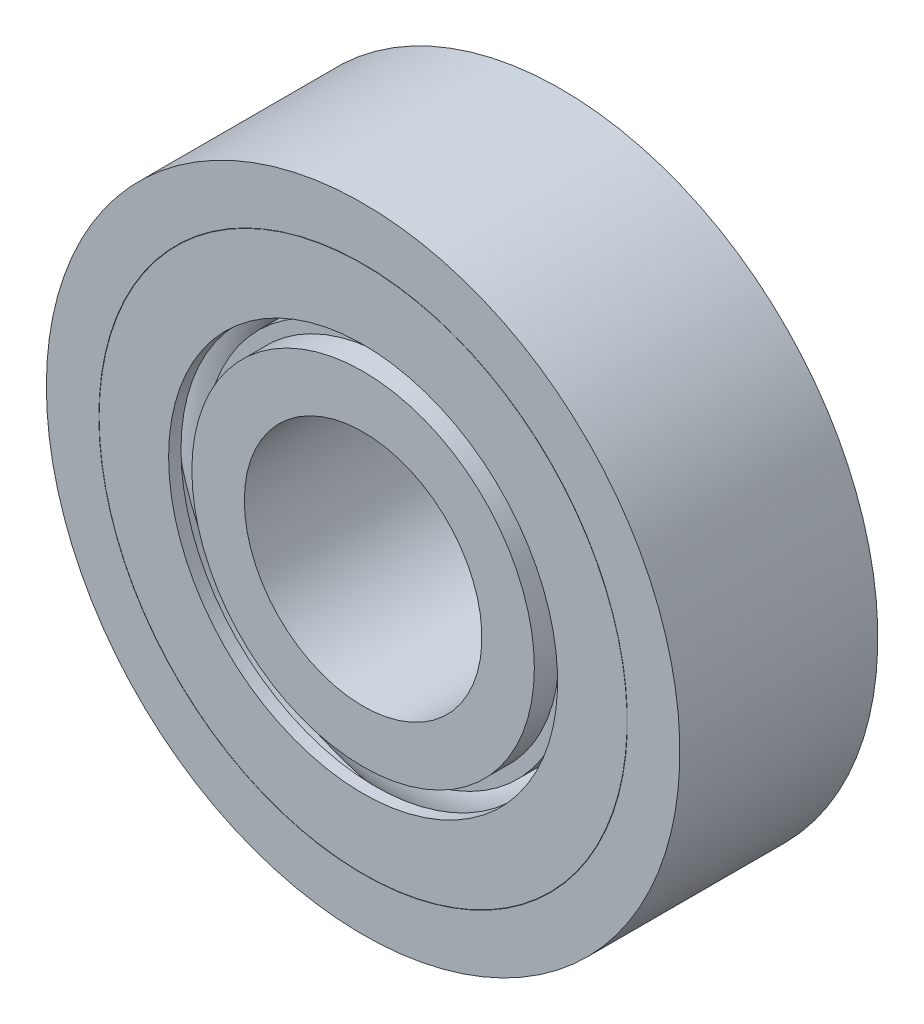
ISO-10303-21;
HEADER;
FILE_DESCRIPTION(('STEP AP214'),'2;1');
FILE_NAME('part.step','',(''),(''),'','','');
FILE_SCHEMA(('AUTOMOTIVE_DESIGN { 1 0 10303 214 1 1 1 1 }'));
ENDSEC;
DATA;
#1=APPLICATION_CONTEXT('core data for automotive mechanical design processes');
#2=APPLICATION_PROTOCOL_DEFINITION('international standard','automotive_design',2000,#1);
#3=PRODUCT_CONTEXT('',#1,'mechanical');
#4=PRODUCT('Part','Part','',(#3));
#5=PRODUCT_RELATED_PRODUCT_CATEGORY('part','',(#4));
#6=PRODUCT_DEFINITION_FORMATION('','',#4);
#7=PRODUCT_DEFINITION_CONTEXT('part definition',#1,'design');
#8=PRODUCT_DEFINITION('design','',#6,#7);
#9=PRODUCT_DEFINITION_SHAPE('','',#8);
#10=(LENGTH_UNIT() NAMED_UNIT(*) SI_UNIT(.MILLI.,.METRE.));
#11=(NAMED_UNIT(*) PLANE_ANGLE_UNIT() SI_UNIT($,.RADIAN.));
#12=(NAMED_UNIT(*) SI_UNIT($,.STERADIAN.) SOLID_ANGLE_UNIT());
#13=UNCERTAINTY_MEASURE_WITH_UNIT(LENGTH_MEASURE(1.E-05),#10,'distance_accuracy_value','');
#14=(GEOMETRIC_REPRESENTATION_CONTEXT(3) GLOBAL_UNCERTAINTY_ASSIGNED_CONTEXT((#13)) GLOBAL_UNIT_ASSIGNED_CONTEXT((#10,
#11,#12)) REPRESENTATION_CONTEXT('',''));
#15=CARTESIAN_POINT('',(0.,0.,0.));
#16=DIRECTION('',(0.,0.,1.));
#17=DIRECTION('',(1.,0.,0.));
#18=AXIS2_PLACEMENT_3D('',#15,#16,#17);
#19=CARTESIAN_POINT('',(0.,0.,5.50000000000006));
#20=DIRECTION('',(0.,0.,-1.));
#21=DIRECTION('',(-1.,0.,0.));
#22=AXIS2_PLACEMENT_3D('',#19,#20,#21);
#23=CYLINDRICAL_SURFACE('',#22,6.);
#24=CARTESIAN_POINT('',(0.,0.,5.));
#25=DIRECTION('',(0.,0.,-1.));
#26=DIRECTION('',(-1.,0.,0.));
#27=AXIS2_PLACEMENT_3D('',#24,#25,#26);
#28=CIRCLE('',#27,6.);
#29=CARTESIAN_POINT('',(-6.,0.,5.));
#30=VERTEX_POINT('',#29);
#31=EDGE_CURVE('P0_E18',#30,#30,#28,.F.);
#32=ORIENTED_EDGE('',*,*,#31,.T.);
#33=EDGE_LOOP('',(#32));
#34=FACE_BOUND('',#33,.T.);
#35=CARTESIAN_POINT('',(0.,0.,-5.));
#36=DIRECTION('',(0.,0.,-1.));
#37=DIRECTION('',(-1.,0.,0.));
#38=AXIS2_PLACEMENT_3D('',#35,#36,#37);
#39=CIRCLE('',#38,6.);
#40=CARTESIAN_POINT('',(-6.,0.,-5.));
#41=VERTEX_POINT('',#40);
#42=EDGE_CURVE('P0_E68',#41,#41,#39,.F.);
#43=ORIENTED_EDGE('',*,*,#42,.F.);
#44=EDGE_LOOP('',(#43));
#45=FACE_BOUND('',#44,.T.);
#46=ADVANCED_FACE('P0_F15',(#34,#45),#23,.F.);
#47=CARTESIAN_POINT('',(0.,0.,5.));
#48=DIRECTION('',(0.,0.,-1.));
#49=DIRECTION('',(-1.,0.,0.));
#50=AXIS2_PLACEMENT_3D('',#47,#48,#49);
#51=PLANE('',#50);
#52=CARTESIAN_POINT('',(0.,0.,5.));
#53=DIRECTION('',(0.,0.,-1.));
#54=DIRECTION('',(-1.,0.,0.));
#55=AXIS2_PLACEMENT_3D('',#52,#53,#54);
#56=CIRCLE('',#55,8.65);
#57=CARTESIAN_POINT('',(-8.65,0.,5.));
#58=VERTEX_POINT('',#57);
#59=EDGE_CURVE('P0_E66',#58,#58,#56,.T.);
#60=ORIENTED_EDGE('',*,*,#59,.F.);
#61=EDGE_LOOP('',(#60));
#62=FACE_BOUND('',#61,.T.);
#63=ORIENTED_EDGE('',*,*,#31,.F.);
#64=EDGE_LOOP('',(#63));
#65=FACE_BOUND('',#64,.T.);
#66=ADVANCED_FACE('P0_F77',(#62,#65),#51,.F.);
#67=CARTESIAN_POINT('',(0.,0.,-5.));
#68=DIRECTION('',(0.,0.,-1.));
#69=DIRECTION('',(-1.,0.,0.));
#70=AXIS2_PLACEMENT_3D('',#67,#68,#69);
#71=PLANE('',#70);
#72=CARTESIAN_POINT('',(0.,0.,-5.));
#73=DIRECTION('',(0.,0.,-1.));
#74=DIRECTION('',(-1.,0.,0.));
#75=AXIS2_PLACEMENT_3D('',#72,#73,#74);
#76=CIRCLE('',#75,8.65);
#77=CARTESIAN_POINT('',(-8.65,0.,-5.));
#78=VERTEX_POINT('',#77);
#79=EDGE_CURVE('P0_E63',#78,#78,#76,.F.);
#80=ORIENTED_EDGE('',*,*,#79,.F.);
#81=EDGE_LOOP('',(#80));
#82=FACE_BOUND('',#81,.T.);
#83=ORIENTED_EDGE('',*,*,#42,.T.);
#84=EDGE_LOOP('',(#83));
#85=FACE_BOUND('',#84,.T.);
#86=ADVANCED_FACE('P0_F79',(#82,#85),#71,.T.);
#87=CARTESIAN_POINT('',(0.,0.,5.50000000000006));
#88=DIRECTION('',(0.,0.,-1.));
#89=DIRECTION('',(-1.,0.,0.));
#90=AXIS2_PLACEMENT_3D('',#87,#88,#89);
#91=CYLINDRICAL_SURFACE('',#90,8.65);
#92=ORIENTED_EDGE('',*,*,#59,.T.);
#93=EDGE_LOOP('',(#92));
#94=FACE_BOUND('',#93,.T.);
#95=CARTESIAN_POINT('',(0.,0.,3.75000000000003));
#96=DIRECTION('',(0.,0.,-1.));
#97=DIRECTION('',(-1.,0.,0.));
#98=AXIS2_PLACEMENT_3D('',#95,#96,#97);
#99=CIRCLE('',#98,8.65);
#100=CARTESIAN_POINT('',(-8.65,0.,3.75000000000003));
#101=VERTEX_POINT('',#100);
#102=EDGE_CURVE('P0_E60',#101,#101,#99,.F.);
#103=ORIENTED_EDGE('',*,*,#102,.T.);
#104=EDGE_LOOP('',(#103));
#105=FACE_BOUND('',#104,.T.);
#106=ADVANCED_FACE('P0_F86',(#94,#105),#91,.T.);
#107=CARTESIAN_POINT('',(0.,0.,5.50000000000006));
#108=DIRECTION('',(0.,0.,-1.));
#109=DIRECTION('',(-1.,0.,0.));
#110=AXIS2_PLACEMENT_3D('',#107,#108,#109);
#111=CYLINDRICAL_SURFACE('',#110,8.65);
#112=ORIENTED_EDGE('',*,*,#79,.T.);
#113=EDGE_LOOP('',(#112));
#114=FACE_BOUND('',#113,.T.);
#115=CARTESIAN_POINT('',(0.,0.,-3.75000000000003));
#116=DIRECTION('',(0.,0.,-1.));
#117=DIRECTION('',(-1.,0.,0.));
#118=AXIS2_PLACEMENT_3D('',#115,#116,#117);
#119=CIRCLE('',#118,8.65);
#120=CARTESIAN_POINT('',(-8.65,0.,-3.75000000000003));
#121=VERTEX_POINT('',#120);
#122=EDGE_CURVE('P0_E57',#121,#121,#119,.F.);
#123=ORIENTED_EDGE('',*,*,#122,.F.);
#124=EDGE_LOOP('',(#123));
#125=FACE_BOUND('',#124,.T.);
#126=ADVANCED_FACE('P0_F173',(#114,#125),#111,.T.);
#127=CARTESIAN_POINT('',(0.,0.,3.75000000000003));
#128=DIRECTION('',(0.,0.,-1.));
#129=DIRECTION('',(-1.,0.,0.));
#130=AXIS2_PLACEMENT_3D('',#127,#128,#129);
#131=PLANE('',#130);
#132=CARTESIAN_POINT('',(0.,0.,3.75000000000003));
#133=DIRECTION('',(0.,0.,-1.));
#134=DIRECTION('',(-1.,0.,0.));
#135=AXIS2_PLACEMENT_3D('',#132,#133,#134);
#136=CIRCLE('',#135,9.26);
#137=CARTESIAN_POINT('',(-9.26,0.,3.75000000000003));
#138=VERTEX_POINT('',#137);
#139=EDGE_CURVE('P0_E54',#138,#138,#136,.T.);
#140=ORIENTED_EDGE('',*,*,#139,.F.);
#141=EDGE_LOOP('',(#140));
#142=FACE_BOUND('',#141,.T.);
#143=ORIENTED_EDGE('',*,*,#102,.F.);
#144=EDGE_LOOP('',(#143));
#145=FACE_BOUND('',#144,.T.);
#146=ADVANCED_FACE('P0_F167',(#142,#145),#131,.F.);
#147=CARTESIAN_POINT('',(0.,0.,-3.75000000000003));
#148=DIRECTION('',(0.,0.,-1.));
#149=DIRECTION('',(-1.,0.,0.));
#150=AXIS2_PLACEMENT_3D('',#147,#148,#149);
#151=PLANE('',#150);
#152=CARTESIAN_POINT('',(0.,0.,-3.75000000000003));
#153=DIRECTION('',(0.,0.,-1.));
#154=DIRECTION('',(-1.,0.,0.));
#155=AXIS2_PLACEMENT_3D('',#152,#153,#154);
#156=CIRCLE('',#155,9.26);
#157=CARTESIAN_POINT('',(-9.26,0.,-3.75000000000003));
#158=VERTEX_POINT('',#157);
#159=EDGE_CURVE('P0_E51',#158,#158,#156,.F.);
#160=ORIENTED_EDGE('',*,*,#159,.F.);
#161=EDGE_LOOP('',(#160));
#162=FACE_BOUND('',#161,.T.);
#163=ORIENTED_EDGE('',*,*,#122,.T.);
#164=EDGE_LOOP('',(#163));
#165=FACE_BOUND('',#164,.T.);
#166=ADVANCED_FACE('P0_F159',(#162,#165),#151,.T.);
#167=CARTESIAN_POINT('',(0.,0.,5.50000000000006));
#168=DIRECTION('',(0.,0.,-1.));
#169=DIRECTION('',(-1.,0.,0.));
#170=AXIS2_PLACEMENT_3D('',#167,#168,#169);
#171=CYLINDRICAL_SURFACE('',#170,9.26);
#172=ORIENTED_EDGE('',*,*,#139,.T.);
#173=EDGE_LOOP('',(#172));
#174=FACE_BOUND('',#173,.T.);
#175=CARTESIAN_POINT('',(0.,0.,1.80900525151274));
#176=DIRECTION('',(0.,0.,-1.));
#177=DIRECTION('',(0.,-1.,0.));
#178=AXIS2_PLACEMENT_3D('',#175,#176,#177);
#179=CIRCLE('',#178,9.26000000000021);
#180=CARTESIAN_POINT('',(0.,-9.26000000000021,1.80900525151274));
#181=VERTEX_POINT('',#180);
#182=EDGE_CURVE('P0_E30',#181,#181,#179,.T.);
#183=ORIENTED_EDGE('',*,*,#182,.F.);
#184=EDGE_LOOP('',(#183));
#185=FACE_BOUND('',#184,.T.);
#186=ADVANCED_FACE('P0_F156',(#174,#185),#171,.T.);
#187=CARTESIAN_POINT('',(0.,0.,5.50000000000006));
#188=DIRECTION('',(0.,0.,-1.));
#189=DIRECTION('',(-1.,0.,0.));
#190=AXIS2_PLACEMENT_3D('',#187,#188,#189);
#191=CYLINDRICAL_SURFACE('',#190,9.26);
#192=CARTESIAN_POINT('',(0.,0.,-1.80900525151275));
#193=DIRECTION('',(0.,0.,-1.));
#194=DIRECTION('',(0.,-1.,0.));
#195=AXIS2_PLACEMENT_3D('',#192,#193,#194);
#196=CIRCLE('',#195,9.26000000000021);
#197=CARTESIAN_POINT('',(0.,-9.26000000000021,-1.80900525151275));
#198=VERTEX_POINT('',#197);
#199=EDGE_CURVE('P0_E146',#198,#198,#196,.F.);
#200=ORIENTED_EDGE('',*,*,#199,.F.);
#201=EDGE_LOOP('',(#200));
#202=FACE_BOUND('',#201,.T.);
#203=ORIENTED_EDGE('',*,*,#159,.T.);
#204=EDGE_LOOP('',(#203));
#205=FACE_BOUND('',#204,.T.);
#206=ADVANCED_FACE('P0_F158',(#202,#205),#191,.T.);
#207=CARTESIAN_POINT('',(0.,0.,0.));
#208=DIRECTION('',(0.,0.,-1.));
#209=DIRECTION('',(0.,-1.,0.));
#210=AXIS2_PLACEMENT_3D('',#207,#208,#209);
#211=TOROIDAL_SURFACE('',#210,11.,2.51);
#212=ORIENTED_EDGE('',*,*,#182,.T.);
#213=EDGE_LOOP('',(#212));
#214=FACE_BOUND('',#213,.T.);
#215=CARTESIAN_POINT('',(0.,0.,1.80900525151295));
#216=DIRECTION('',(0.,0.,-1.));
#217=DIRECTION('',(-1.,0.,0.));
#218=AXIS2_PLACEMENT_3D('',#215,#216,#217);
#219=CIRCLE('',#218,12.74);
#220=CARTESIAN_POINT('',(-12.74,0.,1.80900525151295));
#221=VERTEX_POINT('',#220);
#222=EDGE_CURVE('P0_E144',#221,#221,#219,.F.);
#223=ORIENTED_EDGE('',*,*,#222,.T.);
#224=EDGE_LOOP('',(#223));
#225=FACE_BOUND('',#224,.T.);
#226=ADVANCED_FACE('P0_F137',(#214,#225),#211,.T.);
#227=CARTESIAN_POINT('',(0.,0.,0.));
#228=DIRECTION('',(0.,0.,-1.));
#229=DIRECTION('',(0.,-1.,0.));
#230=AXIS2_PLACEMENT_3D('',#227,#228,#229);
#231=TOROIDAL_SURFACE('',#230,11.,2.51);
#232=CARTESIAN_POINT('',(0.,0.,-1.80900525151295));
#233=DIRECTION('',(0.,0.,-1.));
#234=DIRECTION('',(-1.,0.,0.));
#235=AXIS2_PLACEMENT_3D('',#232,#233,#234);
#236=CIRCLE('',#235,12.74);
#237=CARTESIAN_POINT('',(-12.74,0.,-1.80900525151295));
#238=VERTEX_POINT('',#237);
#239=EDGE_CURVE('P0_E50',#238,#238,#236,.T.);
#240=ORIENTED_EDGE('',*,*,#239,.T.);
#241=EDGE_LOOP('',(#240));
#242=FACE_BOUND('',#241,.T.);
#243=ORIENTED_EDGE('',*,*,#199,.T.);
#244=EDGE_LOOP('',(#243));
#245=FACE_BOUND('',#244,.T.);
#246=ADVANCED_FACE('P0_F132',(#242,#245),#231,.T.);
#247=CARTESIAN_POINT('',(0.,0.,5.50000000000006));
#248=DIRECTION('',(0.,0.,-1.));
#249=DIRECTION('',(-1.,0.,0.));
#250=AXIS2_PLACEMENT_3D('',#247,#248,#249);
#251=CYLINDRICAL_SURFACE('',#250,12.74);
#252=ORIENTED_EDGE('',*,*,#222,.F.);
#253=EDGE_LOOP('',(#252));
#254=FACE_BOUND('',#253,.T.);
#255=CARTESIAN_POINT('',(0.,0.,3.75000000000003));
#256=DIRECTION('',(0.,0.,-1.));
#257=DIRECTION('',(-1.,0.,0.));
#258=AXIS2_PLACEMENT_3D('',#255,#256,#257);
#259=CIRCLE('',#258,12.74);
#260=CARTESIAN_POINT('',(-12.74,0.,3.75000000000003));
#261=VERTEX_POINT('',#260);
#262=EDGE_CURVE('P0_E47',#261,#261,#259,.F.);
#263=ORIENTED_EDGE('',*,*,#262,.T.);
#264=EDGE_LOOP('',(#263));
#265=FACE_BOUND('',#264,.T.);
#266=ADVANCED_FACE('P0_F128',(#254,#265),#251,.F.);
#267=CARTESIAN_POINT('',(0.,0.,5.50000000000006));
#268=DIRECTION('',(0.,0.,-1.));
#269=DIRECTION('',(-1.,0.,0.));
#270=AXIS2_PLACEMENT_3D('',#267,#268,#269);
#271=CYLINDRICAL_SURFACE('',#270,12.74);
#272=ORIENTED_EDGE('',*,*,#239,.F.);
#273=EDGE_LOOP('',(#272));
#274=FACE_BOUND('',#273,.T.);
#275=CARTESIAN_POINT('',(0.,0.,-3.75000000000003));
#276=DIRECTION('',(0.,0.,-1.));
#277=DIRECTION('',(-1.,0.,0.));
#278=AXIS2_PLACEMENT_3D('',#275,#276,#277);
#279=CIRCLE('',#278,12.74);
#280=CARTESIAN_POINT('',(-12.74,0.,-3.75000000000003));
#281=VERTEX_POINT('',#280);
#282=EDGE_CURVE('P0_E44',#281,#281,#279,.F.);
#283=ORIENTED_EDGE('',*,*,#282,.F.);
#284=EDGE_LOOP('',(#283));
#285=FACE_BOUND('',#284,.T.);
#286=ADVANCED_FACE('P0_F124',(#274,#285),#271,.F.);
#287=CARTESIAN_POINT('',(0.,0.,3.75000000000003));
#288=DIRECTION('',(0.,0.,-1.));
#289=DIRECTION('',(-1.,0.,0.));
#290=AXIS2_PLACEMENT_3D('',#287,#288,#289);
#291=PLANE('',#290);
#292=CARTESIAN_POINT('',(0.,0.,3.75000000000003));
#293=DIRECTION('',(0.,0.,-1.));
#294=DIRECTION('',(-1.,0.,0.));
#295=AXIS2_PLACEMENT_3D('',#292,#293,#294);
#296=CIRCLE('',#295,13.35);
#297=CARTESIAN_POINT('',(-13.35,0.,3.75000000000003));
#298=VERTEX_POINT('',#297);
#299=EDGE_CURVE('P0_E41',#298,#298,#296,.F.);
#300=ORIENTED_EDGE('',*,*,#299,.T.);
#301=EDGE_LOOP('',(#300));
#302=FACE_BOUND('',#301,.T.);
#303=ORIENTED_EDGE('',*,*,#262,.F.);
#304=EDGE_LOOP('',(#303));
#305=FACE_BOUND('',#304,.T.);
#306=ADVANCED_FACE('P0_F120',(#302,#305),#291,.F.);
#307=CARTESIAN_POINT('',(0.,0.,-3.75000000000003));
#308=DIRECTION('',(0.,0.,-1.));
#309=DIRECTION('',(-1.,0.,0.));
#310=AXIS2_PLACEMENT_3D('',#307,#308,#309);
#311=PLANE('',#310);
#312=CARTESIAN_POINT('',(0.,0.,-3.75000000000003));
#313=DIRECTION('',(0.,0.,-1.));
#314=DIRECTION('',(-1.,0.,0.));
#315=AXIS2_PLACEMENT_3D('',#312,#313,#314);
#316=CIRCLE('',#315,13.35);
#317=CARTESIAN_POINT('',(-13.35,0.,-3.75000000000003));
#318=VERTEX_POINT('',#317);
#319=EDGE_CURVE('P0_E38',#318,#318,#316,.T.);
#320=ORIENTED_EDGE('',*,*,#319,.T.);
#321=EDGE_LOOP('',(#320));
#322=FACE_BOUND('',#321,.T.);
#323=ORIENTED_EDGE('',*,*,#282,.T.);
#324=EDGE_LOOP('',(#323));
#325=FACE_BOUND('',#324,.T.);
#326=ADVANCED_FACE('P0_F116',(#322,#325),#311,.T.);
#327=CARTESIAN_POINT('',(0.,0.,5.50000000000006));
#328=DIRECTION('',(0.,0.,-1.));
#329=DIRECTION('',(-1.,0.,0.));
#330=AXIS2_PLACEMENT_3D('',#327,#328,#329);
#331=CYLINDRICAL_SURFACE('',#330,13.35);
#332=ORIENTED_EDGE('',*,*,#299,.F.);
#333=EDGE_LOOP('',(#332));
#334=FACE_BOUND('',#333,.T.);
#335=CARTESIAN_POINT('',(0.,0.,5.));
#336=DIRECTION('',(0.,0.,-1.));
#337=DIRECTION('',(-1.,0.,0.));
#338=AXIS2_PLACEMENT_3D('',#335,#336,#337);
#339=CIRCLE('',#338,13.35);
#340=CARTESIAN_POINT('',(-13.35,0.,5.));
#341=VERTEX_POINT('',#340);
#342=EDGE_CURVE('P0_E35',#341,#341,#339,.F.);
#343=ORIENTED_EDGE('',*,*,#342,.T.);
#344=EDGE_LOOP('',(#343));
#345=FACE_BOUND('',#344,.T.);
#346=ADVANCED_FACE('P0_F112',(#334,#345),#331,.F.);
#347=CARTESIAN_POINT('',(0.,0.,5.50000000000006));
#348=DIRECTION('',(0.,0.,-1.));
#349=DIRECTION('',(-1.,0.,0.));
#350=AXIS2_PLACEMENT_3D('',#347,#348,#349);
#351=CYLINDRICAL_SURFACE('',#350,13.35);
#352=ORIENTED_EDGE('',*,*,#319,.F.);
#353=EDGE_LOOP('',(#352));
#354=FACE_BOUND('',#353,.T.);
#355=CARTESIAN_POINT('',(0.,0.,-5.));
#356=DIRECTION('',(0.,0.,-1.));
#357=DIRECTION('',(-1.,0.,0.));
#358=AXIS2_PLACEMENT_3D('',#355,#356,#357);
#359=CIRCLE('',#358,13.35);
#360=CARTESIAN_POINT('',(-13.35,0.,-5.));
#361=VERTEX_POINT('',#360);
#362=EDGE_CURVE('P0_E27',#361,#361,#359,.F.);
#363=ORIENTED_EDGE('',*,*,#362,.F.);
#364=EDGE_LOOP('',(#363));
#365=FACE_BOUND('',#364,.T.);
#366=ADVANCED_FACE('P0_F108',(#354,#365),#351,.F.);
#367=CARTESIAN_POINT('',(0.,0.,5.));
#368=DIRECTION('',(0.,0.,-1.));
#369=DIRECTION('',(-1.,0.,0.));
#370=AXIS2_PLACEMENT_3D('',#367,#368,#369);
#371=PLANE('',#370);
#372=CARTESIAN_POINT('',(0.,0.,5.));
#373=DIRECTION('',(0.,0.,-1.));
#374=DIRECTION('',(-1.,0.,0.));
#375=AXIS2_PLACEMENT_3D('',#372,#373,#374);
#376=CIRCLE('',#375,16.);
#377=CARTESIAN_POINT('',(-16.,0.,5.));
#378=VERTEX_POINT('',#377);
#379=EDGE_CURVE('P0_E22',#378,#378,#376,.T.);
#380=ORIENTED_EDGE('',*,*,#379,.F.);
#381=EDGE_LOOP('',(#380));
#382=FACE_BOUND('',#381,.T.);
#383=ORIENTED_EDGE('',*,*,#342,.F.);
#384=EDGE_LOOP('',(#383));
#385=FACE_BOUND('',#384,.T.);
#386=ADVANCED_FACE('P0_F98',(#382,#385),#371,.F.);
#387=CARTESIAN_POINT('',(0.,0.,-5.));
#388=DIRECTION('',(0.,0.,-1.));
#389=DIRECTION('',(-1.,0.,0.));
#390=AXIS2_PLACEMENT_3D('',#387,#388,#389);
#391=PLANE('',#390);
#392=CARTESIAN_POINT('',(0.,0.,-5.));
#393=DIRECTION('',(0.,0.,-1.));
#394=DIRECTION('',(-1.,0.,0.));
#395=AXIS2_PLACEMENT_3D('',#392,#393,#394);
#396=CIRCLE('',#395,16.);
#397=CARTESIAN_POINT('',(-16.,0.,-5.));
#398=VERTEX_POINT('',#397);
#399=EDGE_CURVE('P0_E10',#398,#398,#396,.F.);
#400=ORIENTED_EDGE('',*,*,#399,.F.);
#401=EDGE_LOOP('',(#400));
#402=FACE_BOUND('',#401,.T.);
#403=ORIENTED_EDGE('',*,*,#362,.T.);
#404=EDGE_LOOP('',(#403));
#405=FACE_BOUND('',#404,.T.);
#406=ADVANCED_FACE('P0_F92',(#402,#405),#391,.T.);
#407=CARTESIAN_POINT('',(0.,0.,5.50000000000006));
#408=DIRECTION('',(0.,0.,-1.));
#409=DIRECTION('',(-1.,0.,0.));
#410=AXIS2_PLACEMENT_3D('',#407,#408,#409);
#411=CYLINDRICAL_SURFACE('',#410,16.);
#412=ORIENTED_EDGE('',*,*,#399,.T.);
#413=EDGE_LOOP('',(#412));
#414=FACE_BOUND('',#413,.T.);
#415=ORIENTED_EDGE('',*,*,#379,.T.);
#416=EDGE_LOOP('',(#415));
#417=FACE_BOUND('',#416,.T.);
#418=ADVANCED_FACE('P0_F90',(#414,#417),#411,.T.);
#419=CLOSED_SHELL('',(#46,#66,#86,#106,#126,#146,#166,#186,#206,#226,#246,#266,#286,#306,#326,
#346,#366,#386,#406,#418));
#420=CARTESIAN_POINT('',(0.,0.,0.));
#421=DIRECTION('',(0.,0.,-1.));
#422=DIRECTION('',(0.,-1.,0.));
#423=AXIS2_PLACEMENT_3D('',#420,#421,#422);
#424=TOROIDAL_SURFACE('',#423,11.,2.5);
#425=ADVANCED_FACE('P0_F103',(),#424,.F.);
#426=CLOSED_SHELL('',(#425));
#427=ORIENTED_CLOSED_SHELL('',*,#426,.T.);
#428=BREP_WITH_VOIDS('P0_B1',#419,(#427));
#429=CARTESIAN_POINT('',(0.,0.,4.37500000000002));
#430=DIRECTION('',(0.,0.,-1.));
#431=DIRECTION('',(-1.,0.,0.));
#432=AXIS2_PLACEMENT_3D('',#429,#430,#431);
#433=PLANE('',#432);
#434=CARTESIAN_POINT('',(0.,0.,4.37500000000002));
#435=DIRECTION('',(0.,0.,-1.));
#436=DIRECTION('',(-1.,0.,0.));
#437=AXIS2_PLACEMENT_3D('',#434,#435,#436);
#438=CIRCLE('',#437,13.335);
#439=CARTESIAN_POINT('',(-13.335,0.,4.37500000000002));
#440=VERTEX_POINT('',#439);
#441=EDGE_CURVE('P1_E26',#440,#440,#438,.F.);
#442=ORIENTED_EDGE('',*,*,#441,.F.);
#443=EDGE_LOOP('',(#442));
#444=FACE_BOUND('',#443,.T.);
#445=CARTESIAN_POINT('',(0.,0.,4.37500000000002));
#446=DIRECTION('',(0.,0.,-1.));
#447=DIRECTION('',(-1.,0.,0.));
#448=AXIS2_PLACEMENT_3D('',#445,#446,#447);
#449=CIRCLE('',#448,9.825);
#450=CARTESIAN_POINT('',(-9.825,0.,4.37500000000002));
#451=VERTEX_POINT('',#450);
#452=EDGE_CURVE('P1_E17',#451,#451,#449,.F.);
#453=ORIENTED_EDGE('',*,*,#452,.T.);
#454=EDGE_LOOP('',(#453));
#455=FACE_BOUND('',#454,.T.);
#456=ADVANCED_FACE('P1_F14',(#444,#455),#433,.T.);
#457=CARTESIAN_POINT('',(0.,0.,5.49999999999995));
#458=DIRECTION('',(0.,0.,-1.));
#459=DIRECTION('',(-1.,0.,0.));
#460=AXIS2_PLACEMENT_3D('',#457,#458,#459);
#461=CYLINDRICAL_SURFACE('',#460,9.825);
#462=ORIENTED_EDGE('',*,*,#452,.F.);
#463=EDGE_LOOP('',(#462));
#464=FACE_BOUND('',#463,.T.);
#465=CARTESIAN_POINT('',(0.,0.,5.));
#466=DIRECTION('',(0.,0.,-1.));
#467=DIRECTION('',(-1.,0.,0.));
#468=AXIS2_PLACEMENT_3D('',#465,#466,#467);
#469=CIRCLE('',#468,9.825);
#470=CARTESIAN_POINT('',(-9.825,0.,5.));
#471=VERTEX_POINT('',#470);
#472=EDGE_CURVE('P1_E21',#471,#471,#469,.F.);
#473=ORIENTED_EDGE('',*,*,#472,.T.);
#474=EDGE_LOOP('',(#473));
#475=FACE_BOUND('',#474,.T.);
#476=ADVANCED_FACE('P1_F35',(#464,#475),#461,.F.);
#477=CARTESIAN_POINT('',(0.,0.,5.49999999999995));
#478=DIRECTION('',(0.,0.,-1.));
#479=DIRECTION('',(-1.,0.,0.));
#480=AXIS2_PLACEMENT_3D('',#477,#478,#479);
#481=CYLINDRICAL_SURFACE('',#480,13.335);
#482=ORIENTED_EDGE('',*,*,#441,.T.);
#483=EDGE_LOOP('',(#482));
#484=FACE_BOUND('',#483,.T.);
#485=CARTESIAN_POINT('',(0.,0.,5.));
#486=DIRECTION('',(0.,0.,-1.));
#487=DIRECTION('',(-1.,0.,0.));
#488=AXIS2_PLACEMENT_3D('',#485,#486,#487);
#489=CIRCLE('',#488,13.335);
#490=CARTESIAN_POINT('',(-13.335,0.,5.));
#491=VERTEX_POINT('',#490);
#492=EDGE_CURVE('P1_E10',#491,#491,#489,.T.);
#493=ORIENTED_EDGE('',*,*,#492,.T.);
#494=EDGE_LOOP('',(#493));
#495=FACE_BOUND('',#494,.T.);
#496=ADVANCED_FACE('P1_F38',(#484,#495),#481,.T.);
#497=CARTESIAN_POINT('',(0.,0.,5.));
#498=DIRECTION('',(0.,0.,-1.));
#499=DIRECTION('',(-1.,0.,0.));
#500=AXIS2_PLACEMENT_3D('',#497,#498,#499);
#501=PLANE('',#500);
#502=ORIENTED_EDGE('',*,*,#492,.F.);
#503=EDGE_LOOP('',(#502));
#504=FACE_BOUND('',#503,.T.);
#505=ORIENTED_EDGE('',*,*,#472,.F.);
#506=EDGE_LOOP('',(#505));
#507=FACE_BOUND('',#506,.T.);
#508=ADVANCED_FACE('P1_F41',(#504,#507),#501,.F.);
#509=CLOSED_SHELL('',(#456,#476,#496,#508));
#510=MANIFOLD_SOLID_BREP('P1_B1',#509);
#511=ADVANCED_BREP_SHAPE_REPRESENTATION('',(#18,#428,#510),#14);
#512=SHAPE_DEFINITION_REPRESENTATION(#9,#511);
ENDSEC;
END-ISO-10303-21;
